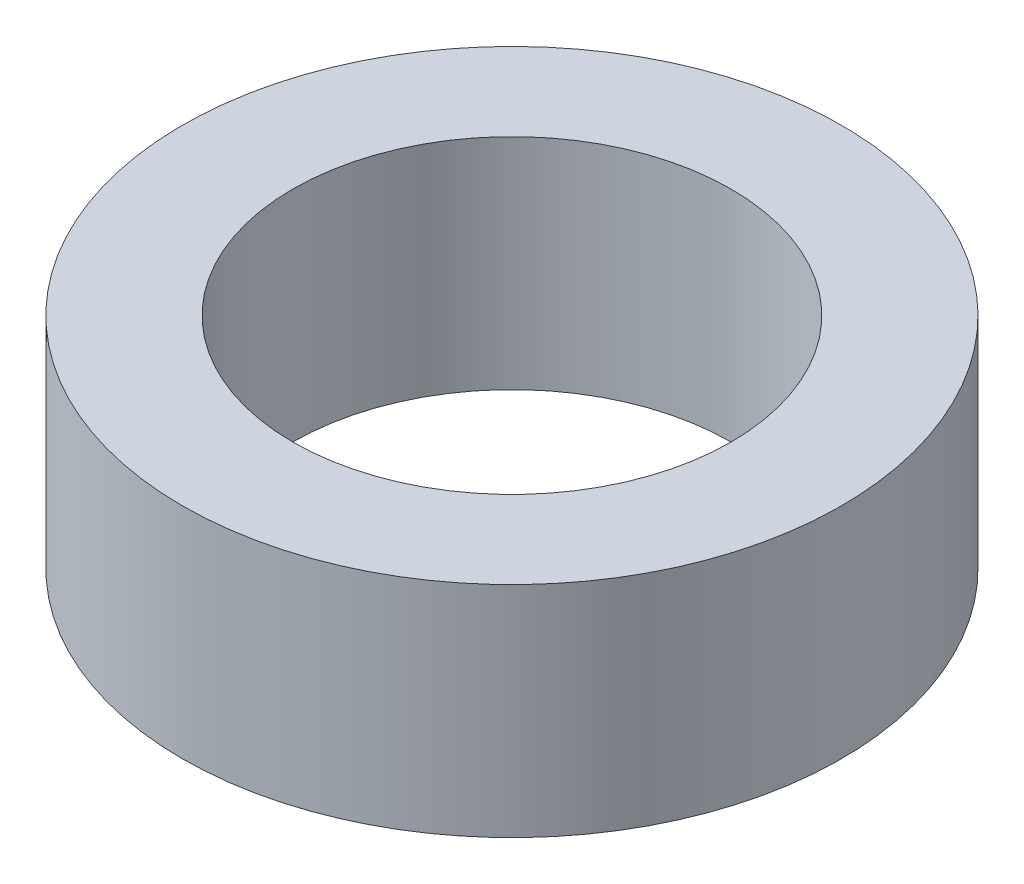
ISO-10303-21;
HEADER;
FILE_DESCRIPTION(('STEP AP214'),'2;1');
FILE_NAME('part.step','',(''),(''),'','','');
FILE_SCHEMA(('AUTOMOTIVE_DESIGN { 1 0 10303 214 1 1 1 1 }'));
ENDSEC;
DATA;
#1=APPLICATION_CONTEXT('core data for automotive mechanical design processes');
#2=APPLICATION_PROTOCOL_DEFINITION('international standard','automotive_design',2000,#1);
#3=PRODUCT_CONTEXT('',#1,'mechanical');
#4=PRODUCT('Part','Part','',(#3));
#5=PRODUCT_RELATED_PRODUCT_CATEGORY('part','',(#4));
#6=PRODUCT_DEFINITION_FORMATION('','',#4);
#7=PRODUCT_DEFINITION_CONTEXT('part definition',#1,'design');
#8=PRODUCT_DEFINITION('design','',#6,#7);
#9=PRODUCT_DEFINITION_SHAPE('','',#8);
#10=(LENGTH_UNIT() NAMED_UNIT(*) SI_UNIT(.MILLI.,.METRE.));
#11=(NAMED_UNIT(*) PLANE_ANGLE_UNIT() SI_UNIT($,.RADIAN.));
#12=(NAMED_UNIT(*) SI_UNIT($,.STERADIAN.) SOLID_ANGLE_UNIT());
#13=UNCERTAINTY_MEASURE_WITH_UNIT(LENGTH_MEASURE(1.E-05),#10,'distance_accuracy_value','');
#14=(GEOMETRIC_REPRESENTATION_CONTEXT(3) GLOBAL_UNCERTAINTY_ASSIGNED_CONTEXT((#13)) GLOBAL_UNIT_ASSIGNED_CONTEXT((#10,
#11,#12)) REPRESENTATION_CONTEXT('',''));
#15=CARTESIAN_POINT('',(0.,0.,0.));
#16=DIRECTION('',(0.,0.,1.));
#17=DIRECTION('',(1.,0.,0.));
#18=AXIS2_PLACEMENT_3D('',#15,#16,#17);
#19=CARTESIAN_POINT('',(0.,0.79375,0.));
#20=DIRECTION('',(0.,1.,0.));
#21=DIRECTION('',(0.,0.,1.));
#22=AXIS2_PLACEMENT_3D('',#19,#20,#21);
#23=PLANE('',#22);
#24=CARTESIAN_POINT('',(0.,0.79375,0.));
#25=DIRECTION('',(0.,1.,0.));
#26=DIRECTION('',(0.,0.,1.));
#27=AXIS2_PLACEMENT_3D('',#24,#25,#26);
#28=CIRCLE('',#27,2.3876);
#29=CARTESIAN_POINT('',(0.,0.79375,2.3876));
#30=VERTEX_POINT('',#29);
#31=EDGE_CURVE('E10',#30,#30,#28,.T.);
#32=ORIENTED_EDGE('',*,*,#31,.T.);
#33=EDGE_LOOP('',(#32));
#34=FACE_BOUND('',#33,.T.);
#35=CARTESIAN_POINT('',(0.,0.79375,0.));
#36=DIRECTION('',(0.,1.,0.));
#37=DIRECTION('',(0.,0.,1.));
#38=AXIS2_PLACEMENT_3D('',#35,#36,#37);
#39=CIRCLE('',#38,1.5875);
#40=CARTESIAN_POINT('',(0.,0.79375,1.5875));
#41=VERTEX_POINT('',#40);
#42=EDGE_CURVE('E42',#41,#41,#39,.T.);
#43=ORIENTED_EDGE('',*,*,#42,.F.);
#44=EDGE_LOOP('',(#43));
#45=FACE_BOUND('',#44,.T.);
#46=ADVANCED_FACE('F31',(#34,#45),#23,.T.);
#47=CARTESIAN_POINT('',(0.,-0.79375,0.));
#48=DIRECTION('',(0.,1.,0.));
#49=DIRECTION('',(0.,0.,1.));
#50=AXIS2_PLACEMENT_3D('',#47,#48,#49);
#51=PLANE('',#50);
#52=CARTESIAN_POINT('',(0.,-0.79375,0.));
#53=DIRECTION('',(0.,1.,0.));
#54=DIRECTION('',(0.,0.,1.));
#55=AXIS2_PLACEMENT_3D('',#52,#53,#54);
#56=CIRCLE('',#55,2.3876);
#57=CARTESIAN_POINT('',(0.,-0.79375,2.3876));
#58=VERTEX_POINT('',#57);
#59=EDGE_CURVE('E35',#58,#58,#56,.T.);
#60=ORIENTED_EDGE('',*,*,#59,.F.);
#61=EDGE_LOOP('',(#60));
#62=FACE_BOUND('',#61,.T.);
#63=CARTESIAN_POINT('',(0.,-0.79375,0.));
#64=DIRECTION('',(0.,1.,0.));
#65=DIRECTION('',(0.,0.,1.));
#66=AXIS2_PLACEMENT_3D('',#63,#64,#65);
#67=CIRCLE('',#66,1.5875);
#68=CARTESIAN_POINT('',(0.,-0.79375,1.5875));
#69=VERTEX_POINT('',#68);
#70=EDGE_CURVE('E44',#69,#69,#67,.T.);
#71=ORIENTED_EDGE('',*,*,#70,.T.);
#72=EDGE_LOOP('',(#71));
#73=FACE_BOUND('',#72,.T.);
#74=ADVANCED_FACE('F54',(#62,#73),#51,.F.);
#75=CARTESIAN_POINT('',(0.,0.79375,0.));
#76=DIRECTION('',(0.,-1.,0.));
#77=DIRECTION('',(0.,0.,-1.));
#78=AXIS2_PLACEMENT_3D('',#75,#76,#77);
#79=CYLINDRICAL_SURFACE('',#78,2.3876);
#80=ORIENTED_EDGE('',*,*,#31,.F.);
#81=EDGE_LOOP('',(#80));
#82=FACE_BOUND('',#81,.T.);
#83=ORIENTED_EDGE('',*,*,#59,.T.);
#84=EDGE_LOOP('',(#83));
#85=FACE_BOUND('',#84,.T.);
#86=ADVANCED_FACE('F33',(#82,#85),#79,.T.);
#87=CARTESIAN_POINT('',(0.,0.79375,0.));
#88=DIRECTION('',(0.,-1.,0.));
#89=DIRECTION('',(0.,0.,-1.));
#90=AXIS2_PLACEMENT_3D('',#87,#88,#89);
#91=CYLINDRICAL_SURFACE('',#90,1.5875);
#92=ORIENTED_EDGE('',*,*,#42,.T.);
#93=EDGE_LOOP('',(#92));
#94=FACE_BOUND('',#93,.T.);
#95=ORIENTED_EDGE('',*,*,#70,.F.);
#96=EDGE_LOOP('',(#95));
#97=FACE_BOUND('',#96,.T.);
#98=ADVANCED_FACE('F50',(#94,#97),#91,.F.);
#99=CLOSED_SHELL('',(#46,#74,#86,#98));
#100=MANIFOLD_SOLID_BREP('B2',#99);
#101=ADVANCED_BREP_SHAPE_REPRESENTATION('',(#18,#100),#14);
#102=SHAPE_DEFINITION_REPRESENTATION(#9,#101);
ENDSEC;
END-ISO-10303-21;
